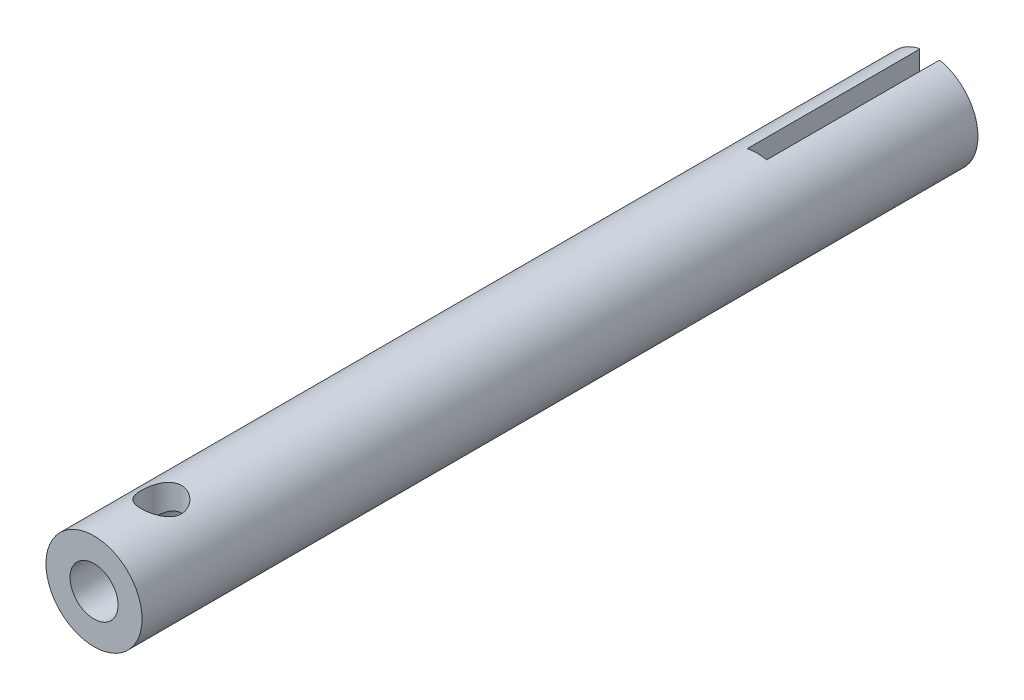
from build123d import *

# Parameters (mm, degrees)
SCHIZZO1_R                   = 5
ESTRUSIONE_ESTRUSIONE1_DEPTH = 87
FORO_5_0_5_1_D               = 5
FORO_5_0_5_1_DEPTH           = 23.497848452
FORO_5_0_5_1_TIP             = 1.502151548
SCHIZZO5_W                   = 2.02
SCHIZZO5_H                   = 11
TAGLIO_ESTRUSIONE1_DEPTH     = 18
SMUSSO1_SIZE                 = 0.1
FORO_FILETTATO_M5_1_REACH    = 89.715
FORO_FILETTATO_M5_1_BORE_R   = 2.1


with BuildPart() as part:
    # Schizzo1 → Estrusione-Estrusione1 (new body)
    with BuildSketch(Plane.XY):
        Circle(SCHIZZO1_R)
    extrude(amount=ESTRUSIONE_ESTRUSIONE1_DEPTH)

    # Foro _5.0 _5_-1
    with Locations(Plane.XY.offset(87)):
        with Locations((0, 0)):
            Hole(FORO_5_0_5_1_D / 2, depth=FORO_5_0_5_1_DEPTH)
            with Locations((0, 0, -(FORO_5_0_5_1_DEPTH + FORO_5_0_5_1_TIP / 2))):  # 118° drill point
                Cone(0, FORO_5_0_5_1_D / 2, FORO_5_0_5_1_TIP, mode=Mode.SUBTRACT)

    # Schizzo5 → Taglio-Estrusione1 (cut)
    with BuildSketch(Plane(origin=(0, 0, 0), x_dir=(-1, 0, 0), z_dir=(0, 0, -1))):
        Rectangle(SCHIZZO5_W, SCHIZZO5_H)
    extrude(amount=-TAGLIO_ESTRUSIONE1_DEPTH, mode=Mode.SUBTRACT)

    # Smusso1
    smusso1_edges = [part.edges().sort_by_distance(p)[0] for p in [
        (1.01, 0, 0),
        (-1.01, 0, 0),
    ]]
    chamfer(smusso1_edges, length=SMUSSO1_SIZE)

    # Foro filettato M5-1 bore → Foro filettato M5-1 (cut, up to next)
    with BuildSketch(Plane(origin=(0, 5, 0), x_dir=(1, 0, 0), z_dir=(0, 1, 0)), mode=Mode.PRIVATE) as foro_filettato_m5_1_sk1:
        with Locations((0, -80)):
            Circle(FORO_FILETTATO_M5_1_BORE_R)
    foro_filettato_m5_1_tool1 = extrude(foro_filettato_m5_1_sk1.sketch, amount=-FORO_FILETTATO_M5_1_REACH, mode=Mode.PRIVATE) & part.part
    add(foro_filettato_m5_1_tool1.solids().sort_by_distance((0, 5, 80))[0], mode=Mode.SUBTRACT)


solid = part.part
